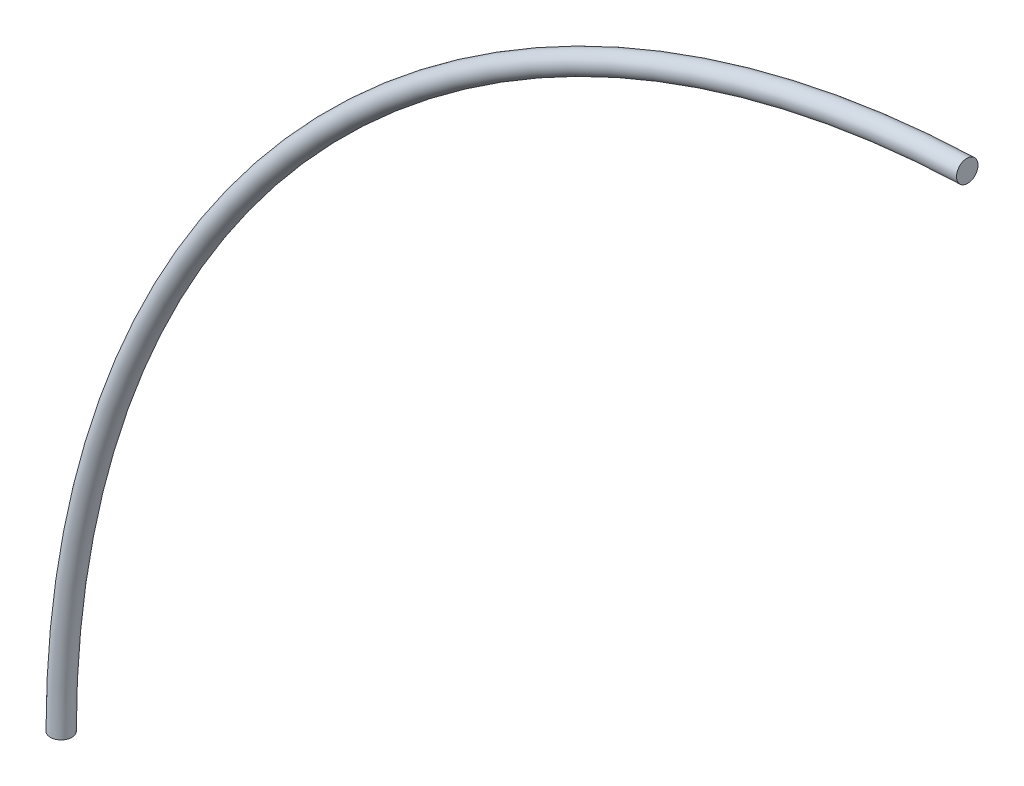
from build123d import *

# Parameters (mm, degrees)
SKETCH2_R = 3.96875


with BuildPart() as part:
    # Sweep1: sweep along a path in Sketch1
    with BuildLine(Plane.XY) as sweep1_path:
        ThreePointArc((-347.373527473, 0), (-249.885328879, 241.3), (-12.139634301, 347.161341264))
    # Sketch2 → Sweep1 (sweep)
    with BuildSketch(Plane(origin=(0, 0, 0), x_dir=(1, 0, 0), z_dir=(0, 1, 0))):
        with Locations((-347.373527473, 0)):
            Circle(SKETCH2_R)
    sweep(path=sweep1_path.line)


solid = part.part
